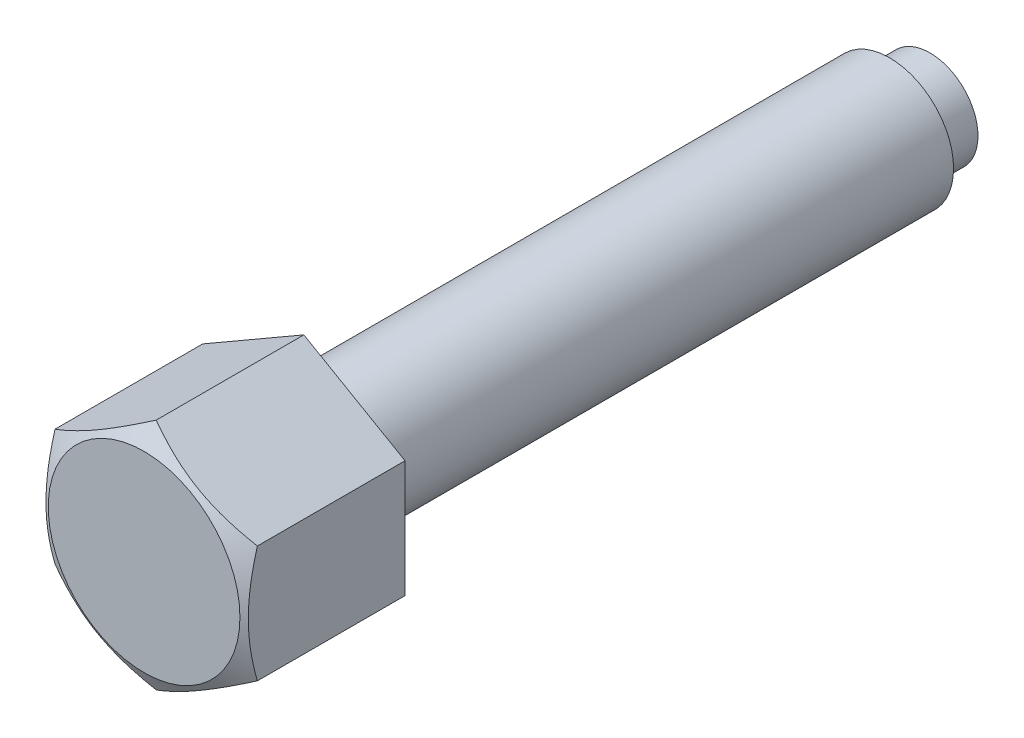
ISO-10303-21;
HEADER;
FILE_DESCRIPTION(('STEP AP214'),'2;1');
FILE_NAME('part.step','',(''),(''),'','','');
FILE_SCHEMA(('AUTOMOTIVE_DESIGN { 1 0 10303 214 1 1 1 1 }'));
ENDSEC;
DATA;
#1=APPLICATION_CONTEXT('core data for automotive mechanical design processes');
#2=APPLICATION_PROTOCOL_DEFINITION('international standard','automotive_design',2000,#1);
#3=PRODUCT_CONTEXT('',#1,'mechanical');
#4=PRODUCT('Part','Part','',(#3));
#5=PRODUCT_RELATED_PRODUCT_CATEGORY('part','',(#4));
#6=PRODUCT_DEFINITION_FORMATION('','',#4);
#7=PRODUCT_DEFINITION_CONTEXT('part definition',#1,'design');
#8=PRODUCT_DEFINITION('design','',#6,#7);
#9=PRODUCT_DEFINITION_SHAPE('','',#8);
#10=(LENGTH_UNIT() NAMED_UNIT(*) SI_UNIT(.MILLI.,.METRE.));
#11=(NAMED_UNIT(*) PLANE_ANGLE_UNIT() SI_UNIT($,.RADIAN.));
#12=(NAMED_UNIT(*) SI_UNIT($,.STERADIAN.) SOLID_ANGLE_UNIT());
#13=UNCERTAINTY_MEASURE_WITH_UNIT(LENGTH_MEASURE(1.E-05),#10,'distance_accuracy_value','');
#14=(GEOMETRIC_REPRESENTATION_CONTEXT(3) GLOBAL_UNCERTAINTY_ASSIGNED_CONTEXT((#13)) GLOBAL_UNIT_ASSIGNED_CONTEXT((#10,
#11,#12)) REPRESENTATION_CONTEXT('',''));
#15=CARTESIAN_POINT('',(0.,0.,0.));
#16=DIRECTION('',(0.,0.,1.));
#17=DIRECTION('',(1.,0.,0.));
#18=AXIS2_PLACEMENT_3D('',#15,#16,#17);
#19=CARTESIAN_POINT('',(0.,10.9696551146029,60.));
#20=DIRECTION('',(-0.5,-0.86602540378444,0.));
#21=DIRECTION('',(0.86602540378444,-0.5,0.));
#22=AXIS2_PLACEMENT_3D('',#19,#20,#21);
#23=PLANE('',#22);
#24=CARTESIAN_POINT('',(9.5002,5.4847120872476,73.862752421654));
#25=CARTESIAN_POINT('',(9.29136922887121,5.60528058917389,73.9323514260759));
#26=CARTESIAN_POINT('',(9.0817598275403,5.72629863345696,73.9987915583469));
#27=CARTESIAN_POINT('',(8.66086011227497,5.96930519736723,74.1244775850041));
#28=CARTESIAN_POINT('',(8.44956926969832,6.09129402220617,74.1837211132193));
#29=CARTESIAN_POINT('',(7.81229220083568,6.45922610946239,74.3495102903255));
#30=CARTESIAN_POINT('',(7.38379023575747,6.70662183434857,74.4438104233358));
#31=CARTESIAN_POINT('',(6.74255666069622,7.07683821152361,74.5543861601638));
#32=CARTESIAN_POINT('',(6.53174078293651,7.19855281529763,74.5858850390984));
#33=CARTESIAN_POINT('',(6.10913296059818,7.4425455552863,74.6387066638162));
#34=CARTESIAN_POINT('',(5.89734099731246,7.56482370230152,74.6600292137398));
#35=CARTESIAN_POINT('',(5.47340378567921,7.80958396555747,74.6919518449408));
#36=CARTESIAN_POINT('',(5.26125925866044,7.93206566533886,74.7025646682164));
#37=CARTESIAN_POINT('',(4.83677424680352,8.17714220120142,74.7128423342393));
#38=CARTESIAN_POINT('',(4.62443376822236,8.2997370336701,74.7125075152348));
#39=CARTESIAN_POINT('',(4.22745800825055,8.52893109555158,74.7016514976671));
#40=CARTESIAN_POINT('',(4.04279470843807,8.63554650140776,74.6924545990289));
#41=CARTESIAN_POINT('',(3.67389999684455,8.84852796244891,74.6659594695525));
#42=CARTESIAN_POINT('',(3.48966861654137,8.95489399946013,74.6486606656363));
#43=CARTESIAN_POINT('',(2.93768832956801,9.27357996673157,74.585020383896));
#44=CARTESIAN_POINT('',(2.57091646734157,9.48533580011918,74.5269429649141));
#45=CARTESIAN_POINT('',(1.8334821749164,9.91109368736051,74.3817488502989));
#46=CARTESIAN_POINT('',(1.46291385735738,10.1250414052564,74.2940166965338));
#47=CARTESIAN_POINT('',(0.727303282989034,10.5497463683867,74.0949011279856));
#48=CARTESIAN_POINT('',(0.362251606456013,10.7605090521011,73.9835644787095));
#49=CARTESIAN_POINT('',(-0.000199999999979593,10.9697705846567,73.862752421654));
#50=B_SPLINE_CURVE_WITH_KNOTS('',3,(#24,#25,#26,#27,#28,#29,#30,#31,#32,#33,#34,#35,#36,#37,#38,
#39,#40,#41,#42,#43,#44,#45,#46,#47,#48,#49),.UNSPECIFIED.,.F.,.F.,(4,2,2,2,2,2,2,2,2,2,2,2,4),
(0.,0.752880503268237,1.50600787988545,3.01546870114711,3.75167336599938,4.48789219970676,
5.22323407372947,5.95855322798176,6.59868084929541,7.23885375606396,8.52010929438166,
9.82978009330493,11.1368800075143),.UNSPECIFIED.);
#51=CARTESIAN_POINT('',(9.5,5.48482755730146,73.8628190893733));
#52=VERTEX_POINT('',#51);
#53=CARTESIAN_POINT('',(0.,10.9696551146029,73.8628190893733));
#54=VERTEX_POINT('',#53);
#55=EDGE_CURVE('E30',#52,#54,#50,.T.);
#56=ORIENTED_EDGE('',*,*,#55,.F.);
#57=DIRECTION('',(0.,0.,1.));
#58=VECTOR('',#57,1.);
#59=CARTESIAN_POINT('',(9.5,5.48482755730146,60.));
#60=LINE('',#59,#58);
#61=CARTESIAN_POINT('',(9.5,5.48482755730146,60.));
#62=VERTEX_POINT('',#61);
#63=EDGE_CURVE('E100',#62,#52,#60,.T.);
#64=ORIENTED_EDGE('',*,*,#63,.F.);
#65=DIRECTION('',(0.86602540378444,-0.5,0.));
#66=VECTOR('',#65,1.);
#67=CARTESIAN_POINT('',(0.,10.9696551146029,60.));
#68=LINE('',#67,#66);
#69=CARTESIAN_POINT('',(0.,10.9696551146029,60.));
#70=VERTEX_POINT('',#69);
#71=EDGE_CURVE('E38',#70,#62,#68,.T.);
#72=ORIENTED_EDGE('',*,*,#71,.F.);
#73=DIRECTION('',(0.,0.,1.));
#74=VECTOR('',#73,1.);
#75=CARTESIAN_POINT('',(0.,10.9696551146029,60.));
#76=LINE('',#75,#74);
#77=EDGE_CURVE('E88',#70,#54,#76,.T.);
#78=ORIENTED_EDGE('',*,*,#77,.T.);
#79=EDGE_LOOP('',(#56,#64,#72,#78));
#80=FACE_BOUND('',#79,.T.);
#81=ADVANCED_FACE('F15',(#80),#23,.F.);
#82=CARTESIAN_POINT('',(9.5,5.48482755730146,60.));
#83=DIRECTION('',(-1.,0.,0.));
#84=DIRECTION('',(0.,0.,1.));
#85=AXIS2_PLACEMENT_3D('',#82,#83,#84);
#86=PLANE('',#85);
#87=CARTESIAN_POINT('',(9.5,-14.6865344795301,70.0975667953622));
#88=CARTESIAN_POINT('',(9.5,-14.4792685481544,70.1980415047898));
#89=CARTESIAN_POINT('',(9.5,-14.2717581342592,70.2980116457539));
#90=CARTESIAN_POINT('',(9.5,-13.8561973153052,70.4968284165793));
#91=CARTESIAN_POINT('',(9.5,-13.6481469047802,70.5956750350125));
#92=CARTESIAN_POINT('',(9.5,-13.0230530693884,70.8903844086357));
#93=CARTESIAN_POINT('',(9.5,-12.6051290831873,71.0843865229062));
#94=CARTESIAN_POINT('',(9.5,-11.7641720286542,71.4673014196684));
#95=CARTESIAN_POINT('',(9.5,-11.3411235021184,71.6561803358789));
#96=CARTESIAN_POINT('',(9.5,-10.4916460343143,72.0261491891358));
#97=CARTESIAN_POINT('',(9.5,-10.065217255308,72.2072394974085));
#98=CARTESIAN_POINT('',(9.5,-9.19472803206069,72.5651486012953));
#99=CARTESIAN_POINT('',(9.5,-8.75053669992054,72.7416508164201));
#100=CARTESIAN_POINT('',(9.5,-7.85694135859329,73.0811844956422));
#101=CARTESIAN_POINT('',(9.5,-7.40753676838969,73.2442144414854));
#102=CARTESIAN_POINT('',(9.5,-6.50365063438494,73.5524889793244));
#103=CARTESIAN_POINT('',(9.5,-6.04918164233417,73.6977699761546));
#104=CARTESIAN_POINT('',(9.5,-5.13374143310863,73.9658563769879));
#105=CARTESIAN_POINT('',(9.5,-4.67277232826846,74.0886689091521));
#106=CARTESIAN_POINT('',(9.5,-3.74653619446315,74.3052367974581));
#107=CARTESIAN_POINT('',(9.5,-3.28130651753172,74.399147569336));
#108=CARTESIAN_POINT('',(9.5,-2.57926289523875,74.5142470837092));
#109=CARTESIAN_POINT('',(9.5,-2.34453094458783,74.548320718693));
#110=CARTESIAN_POINT('',(9.5,-1.87391613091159,74.6072097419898));
#111=CARTESIAN_POINT('',(9.5,-1.63803338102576,74.6320260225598));
#112=CARTESIAN_POINT('',(9.5,-1.16849444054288,74.6715970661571));
#113=CARTESIAN_POINT('',(9.5,-0.934848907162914,74.6864778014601));
#114=CARTESIAN_POINT('',(9.5,-0.467138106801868,74.706348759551));
#115=CARTESIAN_POINT('',(9.5,-0.233072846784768,74.7113391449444));
#116=CARTESIAN_POINT('',(9.5,0.235059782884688,74.7113105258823));
#117=CARTESIAN_POINT('',(9.5,0.469127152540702,74.7062914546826));
#118=CARTESIAN_POINT('',(9.5,0.936843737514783,74.6863656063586));
#119=CARTESIAN_POINT('',(9.5,1.17049293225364,74.6714583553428));
#120=CARTESIAN_POINT('',(9.5,1.73342452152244,74.6239445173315));
#121=CARTESIAN_POINT('',(9.5,2.06231133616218,74.5865686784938));
#122=CARTESIAN_POINT('',(9.5,2.71761546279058,74.4942714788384));
#123=CARTESIAN_POINT('',(9.5,3.04403242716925,74.4393476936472));
#124=CARTESIAN_POINT('',(9.5,3.69409504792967,74.3139084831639));
#125=CARTESIAN_POINT('',(9.5,4.01773831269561,74.2433807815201));
#126=CARTESIAN_POINT('',(9.5,4.66176443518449,74.0888830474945));
#127=CARTESIAN_POINT('',(9.5,4.98214734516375,74.0049132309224));
#128=CARTESIAN_POINT('',(9.5,5.62669491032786,73.8235878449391));
#129=CARTESIAN_POINT('',(9.5,5.95078764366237,73.7259783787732));
#130=CARTESIAN_POINT('',(9.5,6.59577977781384,73.5207777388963));
#131=CARTESIAN_POINT('',(9.5,6.91667915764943,73.4131864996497));
#132=CARTESIAN_POINT('',(9.5,7.55544525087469,73.1897216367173));
#133=CARTESIAN_POINT('',(9.5,7.87331295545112,73.0738508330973));
#134=CARTESIAN_POINT('',(9.5,8.50642102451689,72.8351799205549));
#135=CARTESIAN_POINT('',(9.5,8.82166141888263,72.7123798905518));
#136=CARTESIAN_POINT('',(9.5,9.56212781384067,72.4160560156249));
#137=CARTESIAN_POINT('',(9.5,9.98637708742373,72.2400952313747));
#138=CARTESIAN_POINT('',(9.5,10.8313064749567,71.8797794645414));
#139=CARTESIAN_POINT('',(9.5,11.2519863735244,71.6954239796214));
#140=CARTESIAN_POINT('',(9.5,12.0904383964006,71.3199920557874));
#141=CARTESIAN_POINT('',(9.5,12.5082098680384,71.1289141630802));
#142=CARTESIAN_POINT('',(9.5,13.3412371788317,70.7413865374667));
#143=CARTESIAN_POINT('',(9.5,13.7564930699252,70.5449369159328));
#144=CARTESIAN_POINT('',(9.5,14.5853486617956,70.1474525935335));
#145=CARTESIAN_POINT('',(9.5,14.998946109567,69.9464132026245));
#146=CARTESIAN_POINT('',(9.5,15.8243710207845,69.5407337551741));
#147=CARTESIAN_POINT('',(9.5,16.2361984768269,69.3360936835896));
#148=CARTESIAN_POINT('',(9.5,17.058302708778,68.9238531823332));
#149=CARTESIAN_POINT('',(9.5,17.4685796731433,68.7162531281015));
#150=CARTESIAN_POINT('',(9.5,18.2878578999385,68.2985495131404));
#151=CARTESIAN_POINT('',(9.5,18.6968591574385,68.0884459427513));
#152=CARTESIAN_POINT('',(9.5,19.8542962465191,67.490097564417));
#153=CARTESIAN_POINT('',(9.5,20.6014468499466,67.0993666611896));
#154=CARTESIAN_POINT('',(9.5,22.0929816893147,66.3126106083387));
#155=CARTESIAN_POINT('',(9.5,22.8373658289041,65.9165852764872));
#156=CARTESIAN_POINT('',(9.5,24.3221477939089,65.1214483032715));
#157=CARTESIAN_POINT('',(9.5,25.0625509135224,64.7223465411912));
#158=CARTESIAN_POINT('',(9.5,26.1718492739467,64.1213330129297));
#159=CARTESIAN_POINT('',(9.5,26.5413879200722,63.9206070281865));
#160=CARTESIAN_POINT('',(9.5,27.2800788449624,63.5184466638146));
#161=CARTESIAN_POINT('',(9.5,27.649231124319,63.317012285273));
#162=CARTESIAN_POINT('',(9.5,28.0182120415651,63.1152644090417));
#163=B_SPLINE_CURVE_WITH_KNOTS('',3,(#87,#88,#89,#90,#91,#92,#93,#94,#95,#96,#97,#98,#99,#100,
#101,#102,#103,#104,#105,#106,#107,#108,#109,#110,#111,#112,#113,#114,#115,#116,#117,#118,#119,
#120,#121,#122,#123,#124,#125,#126,#127,#128,#129,#130,#131,#132,#133,#134,#135,#136,#137,#138,
#139,#140,#141,#142,#143,#144,#145,#146,#147,#148,#149,#150,#151,#152,#153,#154,#155,#156,#157,
#158,#159,#160,#161,#162),.UNSPECIFIED.,.F.,.F.,(4,2,2,2,2,2,2,2,2,2,2,2,2,2,2,2,2,2,2,2,2,2,2,
2,2,2,2,2,2,2,2,2,2,2,2,2,2,4),(0.,0.691004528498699,1.38201607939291,2.76424612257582,
4.15407965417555,5.54384686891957,6.97759888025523,8.4115122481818,9.84243329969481,
11.2728995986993,12.6955336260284,13.4069561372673,14.1183100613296,14.8204642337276,
15.5226068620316,16.2247541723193,16.9269351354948,17.9193962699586,18.9119945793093,
19.9053766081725,20.8987426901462,21.9139681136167,22.9292002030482,23.944088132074,
24.9589645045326,26.3367197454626,27.7145575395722,29.0926951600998,30.4708042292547,
31.8503908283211,33.2299831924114,34.6094021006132,35.9888263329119,38.5182490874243,
41.0477591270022,43.5711017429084,44.8327063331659,46.0943089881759),.UNSPECIFIED.);
#164=CARTESIAN_POINT('',(9.5,-5.48482755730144,73.8628190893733));
#165=VERTEX_POINT('',#164);
#166=EDGE_CURVE('E147',#165,#52,#163,.T.);
#167=ORIENTED_EDGE('',*,*,#166,.F.);
#168=DIRECTION('',(0.,0.,1.));
#169=VECTOR('',#168,1.);
#170=CARTESIAN_POINT('',(9.5,-5.48482755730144,60.));
#171=LINE('',#170,#169);
#172=CARTESIAN_POINT('',(9.5,-5.48482755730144,60.));
#173=VERTEX_POINT('',#172);
#174=EDGE_CURVE('E97',#173,#165,#171,.T.);
#175=ORIENTED_EDGE('',*,*,#174,.F.);
#176=DIRECTION('',(0.,-1.,0.));
#177=VECTOR('',#176,1.);
#178=CARTESIAN_POINT('',(9.5,5.48482755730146,60.));
#179=LINE('',#178,#177);
#180=EDGE_CURVE('E162',#62,#173,#179,.T.);
#181=ORIENTED_EDGE('',*,*,#180,.F.);
#182=ORIENTED_EDGE('',*,*,#63,.T.);
#183=EDGE_LOOP('',(#167,#175,#181,#182));
#184=FACE_BOUND('',#183,.T.);
#185=ADVANCED_FACE('F126',(#184),#86,.F.);
#186=CARTESIAN_POINT('',(0.,-10.9696551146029,60.));
#187=DIRECTION('',(0.5,-0.866025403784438,0.));
#188=DIRECTION('',(0.866025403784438,0.5,0.));
#189=AXIS2_PLACEMENT_3D('',#186,#187,#188);
#190=PLANE('',#189);
#191=ORIENTED_EDGE('',*,*,#174,.T.);
#192=CARTESIAN_POINT('',(9.5002,-5.4847120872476,73.862752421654));
#193=CARTESIAN_POINT('',(9.2913692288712,-5.60528058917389,73.9323514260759));
#194=CARTESIAN_POINT('',(9.0817598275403,-5.72629863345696,73.9987915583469));
#195=CARTESIAN_POINT('',(8.66086011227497,-5.96930519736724,74.1244775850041));
#196=CARTESIAN_POINT('',(8.44956926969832,-6.09129402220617,74.1837211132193));
#197=CARTESIAN_POINT('',(7.81229220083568,-6.45922610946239,74.3495102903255));
#198=CARTESIAN_POINT('',(7.38379023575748,-6.70662183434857,74.4438104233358));
#199=CARTESIAN_POINT('',(6.74255666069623,-7.07683821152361,74.5543861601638));
#200=CARTESIAN_POINT('',(6.53174078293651,-7.19855281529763,74.5858850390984));
#201=CARTESIAN_POINT('',(6.10913296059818,-7.4425455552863,74.6387066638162));
#202=CARTESIAN_POINT('',(5.89734099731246,-7.56482370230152,74.6600292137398));
#203=CARTESIAN_POINT('',(5.47340378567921,-7.80958396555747,74.6919518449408));
#204=CARTESIAN_POINT('',(5.26125925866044,-7.93206566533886,74.7025646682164));
#205=CARTESIAN_POINT('',(4.83677424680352,-8.17714220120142,74.7128423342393));
#206=CARTESIAN_POINT('',(4.62443376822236,-8.2997370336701,74.7125075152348));
#207=CARTESIAN_POINT('',(4.22745800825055,-8.52893109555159,74.7016514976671));
#208=CARTESIAN_POINT('',(4.04279470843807,-8.63554650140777,74.6924545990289));
#209=CARTESIAN_POINT('',(3.67389999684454,-8.84852796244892,74.6659594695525));
#210=CARTESIAN_POINT('',(3.48966861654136,-8.95489399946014,74.6486606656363));
#211=CARTESIAN_POINT('',(2.937688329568,-9.27357996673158,74.585020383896));
#212=CARTESIAN_POINT('',(2.57091646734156,-9.48533580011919,74.5269429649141));
#213=CARTESIAN_POINT('',(1.83348217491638,-9.91109368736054,74.3817488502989));
#214=CARTESIAN_POINT('',(1.46291385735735,-10.1250414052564,74.2940166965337));
#215=CARTESIAN_POINT('',(0.727303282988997,-10.5497463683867,74.0949011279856));
#216=CARTESIAN_POINT('',(0.362251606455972,-10.7605090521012,73.9835644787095));
#217=CARTESIAN_POINT('',(-0.000200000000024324,-10.9697705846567,73.862752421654));
#218=B_SPLINE_CURVE_WITH_KNOTS('',3,(#192,#193,#194,#195,#196,#197,#198,#199,#200,#201,#202,
#203,#204,#205,#206,#207,#208,#209,#210,#211,#212,#213,#214,#215,#216,#217),.UNSPECIFIED.,.F.,
.F.,(4,2,2,2,2,2,2,2,2,2,2,2,4),(0.,0.752880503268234,1.50600787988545,3.0154687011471,
3.75167336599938,4.48789219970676,5.22323407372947,5.95855322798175,6.59868084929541,
7.23885375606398,8.52010929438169,9.82978009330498,11.1368800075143),.UNSPECIFIED.);
#219=CARTESIAN_POINT('',(0.,-10.9696551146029,73.8628190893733));
#220=VERTEX_POINT('',#219);
#221=EDGE_CURVE('E173',#165,#220,#218,.T.);
#222=ORIENTED_EDGE('',*,*,#221,.T.);
#223=DIRECTION('',(0.,0.,1.));
#224=VECTOR('',#223,1.);
#225=CARTESIAN_POINT('',(0.,-10.9696551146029,60.));
#226=LINE('',#225,#224);
#227=CARTESIAN_POINT('',(0.,-10.9696551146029,60.));
#228=VERTEX_POINT('',#227);
#229=EDGE_CURVE('E90',#228,#220,#226,.T.);
#230=ORIENTED_EDGE('',*,*,#229,.F.);
#231=DIRECTION('',(0.866025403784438,0.5,0.));
#232=VECTOR('',#231,1.);
#233=CARTESIAN_POINT('',(0.,-10.9696551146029,60.));
#234=LINE('',#233,#232);
#235=EDGE_CURVE('E159',#228,#173,#234,.T.);
#236=ORIENTED_EDGE('',*,*,#235,.T.);
#237=EDGE_LOOP('',(#191,#222,#230,#236));
#238=FACE_BOUND('',#237,.T.);
#239=ADVANCED_FACE('F131',(#238),#190,.T.);
#240=CARTESIAN_POINT('',(0.,-10.9696551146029,60.));
#241=DIRECTION('',(0.5,0.866025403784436,0.));
#242=DIRECTION('',(-0.866025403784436,0.5,0.));
#243=AXIS2_PLACEMENT_3D('',#240,#241,#242);
#244=PLANE('',#243);
#245=CARTESIAN_POINT('',(-9.5002,-5.48471208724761,73.862752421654));
#246=CARTESIAN_POINT('',(-9.2913692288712,-5.6052805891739,73.9323514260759));
#247=CARTESIAN_POINT('',(-9.0817598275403,-5.72629863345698,73.9987915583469));
#248=CARTESIAN_POINT('',(-8.66086011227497,-5.96930519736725,74.1244775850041));
#249=CARTESIAN_POINT('',(-8.44956926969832,-6.09129402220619,74.1837211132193));
#250=CARTESIAN_POINT('',(-7.81229220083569,-6.4592261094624,74.3495102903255));
#251=CARTESIAN_POINT('',(-7.38379023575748,-6.70662183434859,74.4438104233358));
#252=CARTESIAN_POINT('',(-6.74255666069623,-7.07683821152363,74.5543861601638));
#253=CARTESIAN_POINT('',(-6.53174078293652,-7.19855281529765,74.5858850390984));
#254=CARTESIAN_POINT('',(-6.10913296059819,-7.44254555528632,74.6387066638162));
#255=CARTESIAN_POINT('',(-5.89734099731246,-7.56482370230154,74.6600292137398));
#256=CARTESIAN_POINT('',(-5.47340378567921,-7.80958396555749,74.6919518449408));
#257=CARTESIAN_POINT('',(-5.26125925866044,-7.93206566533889,74.7025646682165));
#258=CARTESIAN_POINT('',(-4.83677424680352,-8.17714220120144,74.7128423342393));
#259=CARTESIAN_POINT('',(-4.62443376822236,-8.29973703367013,74.7125075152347));
#260=CARTESIAN_POINT('',(-4.22745800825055,-8.52893109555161,74.701651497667));
#261=CARTESIAN_POINT('',(-4.04279470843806,-8.6355465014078,74.6924545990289));
#262=CARTESIAN_POINT('',(-3.67389999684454,-8.84852796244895,74.6659594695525));
#263=CARTESIAN_POINT('',(-3.48966861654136,-8.95489399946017,74.6486606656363));
#264=CARTESIAN_POINT('',(-2.937688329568,-9.2735799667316,74.585020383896));
#265=CARTESIAN_POINT('',(-2.57091646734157,-9.48533580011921,74.526942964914));
#266=CARTESIAN_POINT('',(-1.8334821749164,-9.91109368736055,74.3817488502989));
#267=CARTESIAN_POINT('',(-1.46291385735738,-10.1250414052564,74.2940166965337));
#268=CARTESIAN_POINT('',(-0.727303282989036,-10.5497463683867,74.0949011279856));
#269=CARTESIAN_POINT('',(-0.362251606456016,-10.7605090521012,73.9835644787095));
#270=CARTESIAN_POINT('',(0.000199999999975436,-10.9697705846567,73.862752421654));
#271=B_SPLINE_CURVE_WITH_KNOTS('',3,(#245,#246,#247,#248,#249,#250,#251,#252,#253,#254,#255,
#256,#257,#258,#259,#260,#261,#262,#263,#264,#265,#266,#267,#268,#269,#270),.UNSPECIFIED.,.F.,
.F.,(4,2,2,2,2,2,2,2,2,2,2,2,4),(0.,0.752880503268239,1.50600787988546,3.01546870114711,
3.75167336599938,4.48789219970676,5.22323407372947,5.95855322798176,6.59868084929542,
7.23885375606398,8.52010929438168,9.82978009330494,11.1368800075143),.UNSPECIFIED.);
#272=CARTESIAN_POINT('',(-9.5,-5.48482755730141,73.8628190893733));
#273=VERTEX_POINT('',#272);
#274=EDGE_CURVE('E82',#273,#220,#271,.T.);
#275=ORIENTED_EDGE('',*,*,#274,.F.);
#276=DIRECTION('',(0.,0.,1.));
#277=VECTOR('',#276,1.);
#278=CARTESIAN_POINT('',(-9.5,-5.48482755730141,60.));
#279=LINE('',#278,#277);
#280=CARTESIAN_POINT('',(-9.5,-5.48482755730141,60.));
#281=VERTEX_POINT('',#280);
#282=EDGE_CURVE('E81',#281,#273,#279,.T.);
#283=ORIENTED_EDGE('',*,*,#282,.F.);
#284=DIRECTION('',(-0.866025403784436,0.5,0.));
#285=VECTOR('',#284,1.);
#286=CARTESIAN_POINT('',(0.,-10.9696551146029,60.));
#287=LINE('',#286,#285);
#288=EDGE_CURVE('E156',#228,#281,#287,.T.);
#289=ORIENTED_EDGE('',*,*,#288,.F.);
#290=ORIENTED_EDGE('',*,*,#229,.T.);
#291=EDGE_LOOP('',(#275,#283,#289,#290));
#292=FACE_BOUND('',#291,.T.);
#293=ADVANCED_FACE('F171',(#292),#244,.F.);
#294=CARTESIAN_POINT('',(-9.5,5.48482755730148,60.));
#295=DIRECTION('',(-1.,0.,0.));
#296=DIRECTION('',(0.,0.,1.));
#297=AXIS2_PLACEMENT_3D('',#294,#295,#296);
#298=PLANE('',#297);
#299=ORIENTED_EDGE('',*,*,#282,.T.);
#300=CARTESIAN_POINT('',(-9.5,-14.6865344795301,70.0975667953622));
#301=CARTESIAN_POINT('',(-9.5,-14.4792685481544,70.1980415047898));
#302=CARTESIAN_POINT('',(-9.5,-14.2717581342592,70.2980116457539));
#303=CARTESIAN_POINT('',(-9.5,-13.8561973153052,70.4968284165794));
#304=CARTESIAN_POINT('',(-9.5,-13.6481469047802,70.5956750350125));
#305=CARTESIAN_POINT('',(-9.5,-13.0230530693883,70.8903844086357));
#306=CARTESIAN_POINT('',(-9.5,-12.6051290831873,71.0843865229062));
#307=CARTESIAN_POINT('',(-9.5,-11.7641720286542,71.4673014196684));
#308=CARTESIAN_POINT('',(-9.5,-11.3411235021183,71.6561803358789));
#309=CARTESIAN_POINT('',(-9.5,-10.4916460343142,72.0261491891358));
#310=CARTESIAN_POINT('',(-9.5,-10.0652172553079,72.2072394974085));
#311=CARTESIAN_POINT('',(-9.5,-9.19472803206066,72.5651486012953));
#312=CARTESIAN_POINT('',(-9.5,-8.7505366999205,72.7416508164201));
#313=CARTESIAN_POINT('',(-9.5,-7.85694135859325,73.0811844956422));
#314=CARTESIAN_POINT('',(-9.5,-7.40753676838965,73.2442144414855));
#315=CARTESIAN_POINT('',(-9.5,-6.5036506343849,73.5524889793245));
#316=CARTESIAN_POINT('',(-9.5,-6.04918164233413,73.6977699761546));
#317=CARTESIAN_POINT('',(-9.5,-5.13374143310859,73.9658563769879));
#318=CARTESIAN_POINT('',(-9.5,-4.67277232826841,74.0886689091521));
#319=CARTESIAN_POINT('',(-9.5,-3.74653619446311,74.3052367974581));
#320=CARTESIAN_POINT('',(-9.5,-3.28130651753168,74.399147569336));
#321=CARTESIAN_POINT('',(-9.5,-2.57926289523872,74.5142470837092));
#322=CARTESIAN_POINT('',(-9.5,-2.34453094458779,74.548320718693));
#323=CARTESIAN_POINT('',(-9.5,-1.87391613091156,74.6072097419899));
#324=CARTESIAN_POINT('',(-9.5,-1.63803338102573,74.6320260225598));
#325=CARTESIAN_POINT('',(-9.5,-1.16849444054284,74.6715970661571));
#326=CARTESIAN_POINT('',(-9.5,-0.934848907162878,74.6864778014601));
#327=CARTESIAN_POINT('',(-9.5,-0.467138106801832,74.706348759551));
#328=CARTESIAN_POINT('',(-9.5,-0.233072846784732,74.7113391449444));
#329=CARTESIAN_POINT('',(-9.5,0.235059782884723,74.7113105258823));
#330=CARTESIAN_POINT('',(-9.5,0.469127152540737,74.7062914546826));
#331=CARTESIAN_POINT('',(-9.5,0.936843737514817,74.6863656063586));
#332=CARTESIAN_POINT('',(-9.5,1.17049293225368,74.6714583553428));
#333=CARTESIAN_POINT('',(-9.5,1.73342452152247,74.6239445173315));
#334=CARTESIAN_POINT('',(-9.5,2.06231133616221,74.5865686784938));
#335=CARTESIAN_POINT('',(-9.5,2.71761546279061,74.4942714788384));
#336=CARTESIAN_POINT('',(-9.5,3.04403242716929,74.4393476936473));
#337=CARTESIAN_POINT('',(-9.5,3.69409504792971,74.3139084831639));
#338=CARTESIAN_POINT('',(-9.5,4.01773831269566,74.2433807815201));
#339=CARTESIAN_POINT('',(-9.5,4.66176443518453,74.0888830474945));
#340=CARTESIAN_POINT('',(-9.5,4.98214734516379,74.0049132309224));
#341=CARTESIAN_POINT('',(-9.5,5.6266949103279,73.8235878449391));
#342=CARTESIAN_POINT('',(-9.5,5.95078764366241,73.7259783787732));
#343=CARTESIAN_POINT('',(-9.5,6.59577977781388,73.5207777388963));
#344=CARTESIAN_POINT('',(-9.5,6.91667915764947,73.4131864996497));
#345=CARTESIAN_POINT('',(-9.5,7.55544525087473,73.1897216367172));
#346=CARTESIAN_POINT('',(-9.5,7.87331295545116,73.0738508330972));
#347=CARTESIAN_POINT('',(-9.5,8.50642102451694,72.8351799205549));
#348=CARTESIAN_POINT('',(-9.5,8.82166141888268,72.7123798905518));
#349=CARTESIAN_POINT('',(-9.5,9.56212781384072,72.4160560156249));
#350=CARTESIAN_POINT('',(-9.5,9.98637708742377,72.2400952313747));
#351=CARTESIAN_POINT('',(-9.5,10.8313064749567,71.8797794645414));
#352=CARTESIAN_POINT('',(-9.5,11.2519863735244,71.6954239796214));
#353=CARTESIAN_POINT('',(-9.5,12.0904383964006,71.3199920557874));
#354=CARTESIAN_POINT('',(-9.5,12.5082098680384,71.1289141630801));
#355=CARTESIAN_POINT('',(-9.5,13.3412371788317,70.7413865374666));
#356=CARTESIAN_POINT('',(-9.5,13.7564930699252,70.5449369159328));
#357=CARTESIAN_POINT('',(-9.5,14.5853486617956,70.1474525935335));
#358=CARTESIAN_POINT('',(-9.5,14.998946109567,69.9464132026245));
#359=CARTESIAN_POINT('',(-9.5,15.8243710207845,69.5407337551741));
#360=CARTESIAN_POINT('',(-9.5,16.2361984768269,69.3360936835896));
#361=CARTESIAN_POINT('',(-9.5,17.0583027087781,68.9238531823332));
#362=CARTESIAN_POINT('',(-9.5,17.4685796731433,68.7162531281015));
#363=CARTESIAN_POINT('',(-9.5,18.2878578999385,68.2985495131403));
#364=CARTESIAN_POINT('',(-9.5,18.6968591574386,68.0884459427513));
#365=CARTESIAN_POINT('',(-9.5,19.8542962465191,67.490097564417));
#366=CARTESIAN_POINT('',(-9.5,20.6014468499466,67.0993666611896));
#367=CARTESIAN_POINT('',(-9.5,22.0929816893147,66.3126106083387));
#368=CARTESIAN_POINT('',(-9.5,22.8373658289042,65.9165852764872));
#369=CARTESIAN_POINT('',(-9.5,24.3221477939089,65.1214483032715));
#370=CARTESIAN_POINT('',(-9.5,25.0625509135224,64.7223465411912));
#371=CARTESIAN_POINT('',(-9.5,26.1718492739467,64.1213330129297));
#372=CARTESIAN_POINT('',(-9.5,26.5413879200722,63.9206070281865));
#373=CARTESIAN_POINT('',(-9.5,27.2800788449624,63.5184466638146));
#374=CARTESIAN_POINT('',(-9.5,27.649231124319,63.317012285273));
#375=CARTESIAN_POINT('',(-9.5,28.0182120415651,63.1152644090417));
#376=B_SPLINE_CURVE_WITH_KNOTS('',3,(#300,#301,#302,#303,#304,#305,#306,#307,#308,#309,#310,
#311,#312,#313,#314,#315,#316,#317,#318,#319,#320,#321,#322,#323,#324,#325,#326,#327,#328,#329,
#330,#331,#332,#333,#334,#335,#336,#337,#338,#339,#340,#341,#342,#343,#344,#345,#346,#347,#348,
#349,#350,#351,#352,#353,#354,#355,#356,#357,#358,#359,#360,#361,#362,#363,#364,#365,#366,#367,
#368,#369,#370,#371,#372,#373,#374,#375),.UNSPECIFIED.,.F.,.F.,(4,2,2,2,2,2,2,2,2,2,2,2,2,2,2,2,
2,2,2,2,2,2,2,2,2,2,2,2,2,2,2,2,2,2,2,2,2,4),(0.,0.691004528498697,1.38201607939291,
2.76424612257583,4.15407965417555,5.54384686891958,6.97759888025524,8.41151224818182,
9.84243329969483,11.2728995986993,12.6955336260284,13.4069561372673,14.1183100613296,
14.8204642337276,15.5226068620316,16.2247541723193,16.9269351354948,17.9193962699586,
18.9119945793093,19.9053766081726,20.8987426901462,21.9139681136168,22.9292002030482,
23.944088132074,24.9589645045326,26.3367197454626,27.7145575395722,29.0926951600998,
30.4708042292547,31.850390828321,33.2299831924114,34.6094021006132,35.9888263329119,
38.5182490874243,41.0477591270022,43.5711017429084,44.8327063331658,46.0943089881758),.UNSPECIFIED.);
#377=CARTESIAN_POINT('',(-9.5,5.48482755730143,73.8628190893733));
#378=VERTEX_POINT('',#377);
#379=EDGE_CURVE('E69',#273,#378,#376,.T.);
#380=ORIENTED_EDGE('',*,*,#379,.T.);
#381=DIRECTION('',(0.,0.,1.));
#382=VECTOR('',#381,1.);
#383=CARTESIAN_POINT('',(-9.5,5.48482755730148,60.));
#384=LINE('',#383,#382);
#385=CARTESIAN_POINT('',(-9.5,5.48482755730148,60.));
#386=VERTEX_POINT('',#385);
#387=EDGE_CURVE('E79',#386,#378,#384,.T.);
#388=ORIENTED_EDGE('',*,*,#387,.F.);
#389=DIRECTION('',(0.,-1.,0.));
#390=VECTOR('',#389,1.);
#391=CARTESIAN_POINT('',(-9.5,5.48482755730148,60.));
#392=LINE('',#391,#390);
#393=EDGE_CURVE('E154',#386,#281,#392,.T.);
#394=ORIENTED_EDGE('',*,*,#393,.T.);
#395=EDGE_LOOP('',(#299,#380,#388,#394));
#396=FACE_BOUND('',#395,.T.);
#397=ADVANCED_FACE('F77',(#396),#298,.T.);
#398=CARTESIAN_POINT('',(0.,10.9696551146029,60.));
#399=DIRECTION('',(-0.5,0.866025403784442,0.));
#400=DIRECTION('',(-0.866025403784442,-0.5,0.));
#401=AXIS2_PLACEMENT_3D('',#398,#399,#400);
#402=PLANE('',#401);
#403=ORIENTED_EDGE('',*,*,#387,.T.);
#404=CARTESIAN_POINT('',(-9.5002,5.48471208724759,73.862752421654));
#405=CARTESIAN_POINT('',(-9.2913692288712,5.60528058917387,73.9323514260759));
#406=CARTESIAN_POINT('',(-9.0817598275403,5.72629863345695,73.9987915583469));
#407=CARTESIAN_POINT('',(-8.66086011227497,5.96930519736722,74.1244775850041));
#408=CARTESIAN_POINT('',(-8.44956926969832,6.09129402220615,74.1837211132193));
#409=CARTESIAN_POINT('',(-7.81229220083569,6.45922610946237,74.3495102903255));
#410=CARTESIAN_POINT('',(-7.38379023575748,6.70662183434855,74.4438104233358));
#411=CARTESIAN_POINT('',(-6.74255666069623,7.07683821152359,74.5543861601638));
#412=CARTESIAN_POINT('',(-6.53174078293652,7.19855281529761,74.5858850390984));
#413=CARTESIAN_POINT('',(-6.10913296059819,7.44254555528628,74.6387066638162));
#414=CARTESIAN_POINT('',(-5.89734099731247,7.56482370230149,74.6600292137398));
#415=CARTESIAN_POINT('',(-5.47340378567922,7.80958396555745,74.6919518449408));
#416=CARTESIAN_POINT('',(-5.26125925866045,7.93206566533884,74.7025646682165));
#417=CARTESIAN_POINT('',(-4.83677424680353,8.17714220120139,74.7128423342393));
#418=CARTESIAN_POINT('',(-4.62443376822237,8.29973703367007,74.7125075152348));
#419=CARTESIAN_POINT('',(-4.22745800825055,8.52893109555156,74.7016514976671));
#420=CARTESIAN_POINT('',(-4.04279470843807,8.63554650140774,74.6924545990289));
#421=CARTESIAN_POINT('',(-3.67389999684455,8.84852796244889,74.6659594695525));
#422=CARTESIAN_POINT('',(-3.48966861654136,8.95489399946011,74.6486606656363));
#423=CARTESIAN_POINT('',(-2.937688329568,9.27357996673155,74.585020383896));
#424=CARTESIAN_POINT('',(-2.57091646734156,9.48533580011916,74.5269429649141));
#425=CARTESIAN_POINT('',(-1.83348217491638,9.9110936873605,74.381748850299));
#426=CARTESIAN_POINT('',(-1.46291385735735,10.1250414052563,74.2940166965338));
#427=CARTESIAN_POINT('',(-0.727303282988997,10.5497463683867,74.0949011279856));
#428=CARTESIAN_POINT('',(-0.362251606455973,10.7605090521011,73.9835644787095));
#429=CARTESIAN_POINT('',(0.000200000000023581,10.9697705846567,73.862752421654));
#430=B_SPLINE_CURVE_WITH_KNOTS('',3,(#404,#405,#406,#407,#408,#409,#410,#411,#412,#413,#414,
#415,#416,#417,#418,#419,#420,#421,#422,#423,#424,#425,#426,#427,#428,#429),.UNSPECIFIED.,.F.,
.F.,(4,2,2,2,2,2,2,2,2,2,2,2,4),(0.,0.752880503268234,1.50600787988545,3.0154687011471,
3.75167336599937,4.48789219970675,5.22323407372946,5.95855322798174,6.5986808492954,
7.23885375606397,8.52010929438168,9.82978009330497,11.1368800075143),.UNSPECIFIED.);
#431=EDGE_CURVE('E66',#378,#54,#430,.T.);
#432=ORIENTED_EDGE('',*,*,#431,.T.);
#433=ORIENTED_EDGE('',*,*,#77,.F.);
#434=DIRECTION('',(-0.866025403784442,-0.5,0.));
#435=VECTOR('',#434,1.);
#436=CARTESIAN_POINT('',(0.,10.9696551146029,60.));
#437=LINE('',#436,#435);
#438=EDGE_CURVE('E86',#70,#386,#437,.T.);
#439=ORIENTED_EDGE('',*,*,#438,.T.);
#440=EDGE_LOOP('',(#403,#432,#433,#439));
#441=FACE_BOUND('',#440,.T.);
#442=ADVANCED_FACE('F84',(#441),#402,.T.);
#443=CARTESIAN_POINT('',(0.,0.,9.));
#444=DIRECTION('',(0.,0.,1.));
#445=DIRECTION('',(1.,0.,0.));
#446=AXIS2_PLACEMENT_3D('',#443,#444,#445);
#447=SPHERICAL_SURFACE('',#446,9.);
#448=CARTESIAN_POINT('',(0.,0.,1.20577136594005));
#449=DIRECTION('',(0.,0.,1.));
#450=DIRECTION('',(1.,0.,0.));
#451=AXIS2_PLACEMENT_3D('',#448,#449,#450);
#452=CIRCLE('',#451,4.5);
#453=CARTESIAN_POINT('',(4.5,0.,1.20577136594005));
#454=VERTEX_POINT('',#453);
#455=EDGE_CURVE('E9',#454,#454,#452,.T.);
#456=ORIENTED_EDGE('',*,*,#455,.F.);
#457=EDGE_LOOP('',(#456));
#458=FACE_BOUND('',#457,.T.);
#459=ADVANCED_FACE('F17',(#458),#447,.T.);
#460=CARTESIAN_POINT('',(0.,0.,110.));
#461=DIRECTION('',(0.,0.,1.));
#462=DIRECTION('',(1.,0.,0.));
#463=AXIS2_PLACEMENT_3D('',#460,#461,#462);
#464=CYLINDRICAL_SURFACE('',#463,4.5);
#465=ORIENTED_EDGE('',*,*,#455,.T.);
#466=EDGE_LOOP('',(#465));
#467=FACE_BOUND('',#466,.T.);
#468=CARTESIAN_POINT('',(0.,0.,5.));
#469=DIRECTION('',(0.,0.,1.));
#470=DIRECTION('',(1.,0.,0.));
#471=AXIS2_PLACEMENT_3D('',#468,#469,#470);
#472=CIRCLE('',#471,4.5);
#473=CARTESIAN_POINT('',(4.5,0.,5.));
#474=VERTEX_POINT('',#473);
#475=EDGE_CURVE('E23',#474,#474,#472,.T.);
#476=ORIENTED_EDGE('',*,*,#475,.F.);
#477=EDGE_LOOP('',(#476));
#478=FACE_BOUND('',#477,.T.);
#479=ADVANCED_FACE('F113',(#467,#478),#464,.T.);
#480=CARTESIAN_POINT('',(4.5,0.,5.));
#481=DIRECTION('',(0.,0.,1.));
#482=DIRECTION('',(1.,0.,0.));
#483=AXIS2_PLACEMENT_3D('',#480,#481,#482);
#484=PLANE('',#483);
#485=CARTESIAN_POINT('',(0.,0.,5.));
#486=DIRECTION('',(0.,0.,1.));
#487=DIRECTION('',(1.,0.,0.));
#488=AXIS2_PLACEMENT_3D('',#485,#486,#487);
#489=CIRCLE('',#488,6.);
#490=CARTESIAN_POINT('',(6.,0.,5.));
#491=VERTEX_POINT('',#490);
#492=EDGE_CURVE('E106',#491,#491,#489,.T.);
#493=ORIENTED_EDGE('',*,*,#492,.F.);
#494=EDGE_LOOP('',(#493));
#495=FACE_BOUND('',#494,.T.);
#496=ORIENTED_EDGE('',*,*,#475,.T.);
#497=EDGE_LOOP('',(#496));
#498=FACE_BOUND('',#497,.T.);
#499=ADVANCED_FACE('F111',(#495,#498),#484,.F.);
#500=CARTESIAN_POINT('',(0.,0.,110.));
#501=DIRECTION('',(0.,0.,1.));
#502=DIRECTION('',(1.,0.,0.));
#503=AXIS2_PLACEMENT_3D('',#500,#501,#502);
#504=CYLINDRICAL_SURFACE('',#503,6.);
#505=CARTESIAN_POINT('',(0.,0.,60.));
#506=DIRECTION('',(0.,0.,1.));
#507=DIRECTION('',(1.,0.,0.));
#508=AXIS2_PLACEMENT_3D('',#505,#506,#507);
#509=CIRCLE('',#508,6.);
#510=CARTESIAN_POINT('',(6.,0.,60.));
#511=VERTEX_POINT('',#510);
#512=EDGE_CURVE('E103',#511,#511,#509,.T.);
#513=ORIENTED_EDGE('',*,*,#512,.F.);
#514=EDGE_LOOP('',(#513));
#515=FACE_BOUND('',#514,.T.);
#516=ORIENTED_EDGE('',*,*,#492,.T.);
#517=EDGE_LOOP('',(#516));
#518=FACE_BOUND('',#517,.T.);
#519=ADVANCED_FACE('F121',(#515,#518),#504,.T.);
#520=CARTESIAN_POINT('',(6.,0.,60.));
#521=DIRECTION('',(0.,0.,1.));
#522=DIRECTION('',(1.,0.,0.));
#523=AXIS2_PLACEMENT_3D('',#520,#521,#522);
#524=PLANE('',#523);
#525=ORIENTED_EDGE('',*,*,#438,.F.);
#526=ORIENTED_EDGE('',*,*,#71,.T.);
#527=ORIENTED_EDGE('',*,*,#180,.T.);
#528=ORIENTED_EDGE('',*,*,#235,.F.);
#529=ORIENTED_EDGE('',*,*,#288,.T.);
#530=ORIENTED_EDGE('',*,*,#393,.F.);
#531=EDGE_LOOP('',(#525,#526,#527,#528,#529,#530));
#532=FACE_BOUND('',#531,.T.);
#533=ORIENTED_EDGE('',*,*,#512,.T.);
#534=EDGE_LOOP('',(#533));
#535=FACE_BOUND('',#534,.T.);
#536=ADVANCED_FACE('F165',(#532,#535),#524,.F.);
#537=CARTESIAN_POINT('',(0.,0.,75.));
#538=DIRECTION('',(0.,0.,-1.));
#539=DIRECTION('',(-1.,0.,0.));
#540=AXIS2_PLACEMENT_3D('',#537,#538,#539);
#541=CONICAL_SURFACE('',#540,9.,1.0471975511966);
#542=CARTESIAN_POINT('',(0.,0.,75.));
#543=DIRECTION('',(0.,0.,1.));
#544=DIRECTION('',(1.,0.,0.));
#545=AXIS2_PLACEMENT_3D('',#542,#543,#544);
#546=CIRCLE('',#545,9.);
#547=CARTESIAN_POINT('',(9.,0.,75.));
#548=VERTEX_POINT('',#547);
#549=EDGE_CURVE('E73',#548,#548,#546,.T.);
#550=ORIENTED_EDGE('',*,*,#549,.F.);
#551=EDGE_LOOP('',(#550));
#552=FACE_BOUND('',#551,.T.);
#553=ORIENTED_EDGE('',*,*,#55,.T.);
#554=ORIENTED_EDGE('',*,*,#431,.F.);
#555=ORIENTED_EDGE('',*,*,#379,.F.);
#556=ORIENTED_EDGE('',*,*,#274,.T.);
#557=ORIENTED_EDGE('',*,*,#221,.F.);
#558=ORIENTED_EDGE('',*,*,#166,.T.);
#559=EDGE_LOOP('',(#553,#554,#555,#556,#557,#558));
#560=FACE_BOUND('',#559,.T.);
#561=ADVANCED_FACE('F68',(#552,#560),#541,.T.);
#562=CARTESIAN_POINT('',(0.,0.,75.));
#563=DIRECTION('',(0.,0.,1.));
#564=DIRECTION('',(1.,0.,0.));
#565=AXIS2_PLACEMENT_3D('',#562,#563,#564);
#566=PLANE('',#565);
#567=ORIENTED_EDGE('',*,*,#549,.T.);
#568=EDGE_LOOP('',(#567));
#569=FACE_BOUND('',#568,.T.);
#570=ADVANCED_FACE('F197',(#569),#566,.T.);
#571=CLOSED_SHELL('',(#81,#185,#239,#293,#397,#442,#459,#479,#499,#519,#536,#561,#570));
#572=MANIFOLD_SOLID_BREP('B1',#571);
#573=ADVANCED_BREP_SHAPE_REPRESENTATION('',(#18,#572),#14);
#574=SHAPE_DEFINITION_REPRESENTATION(#9,#573);
ENDSEC;
END-ISO-10303-21;
